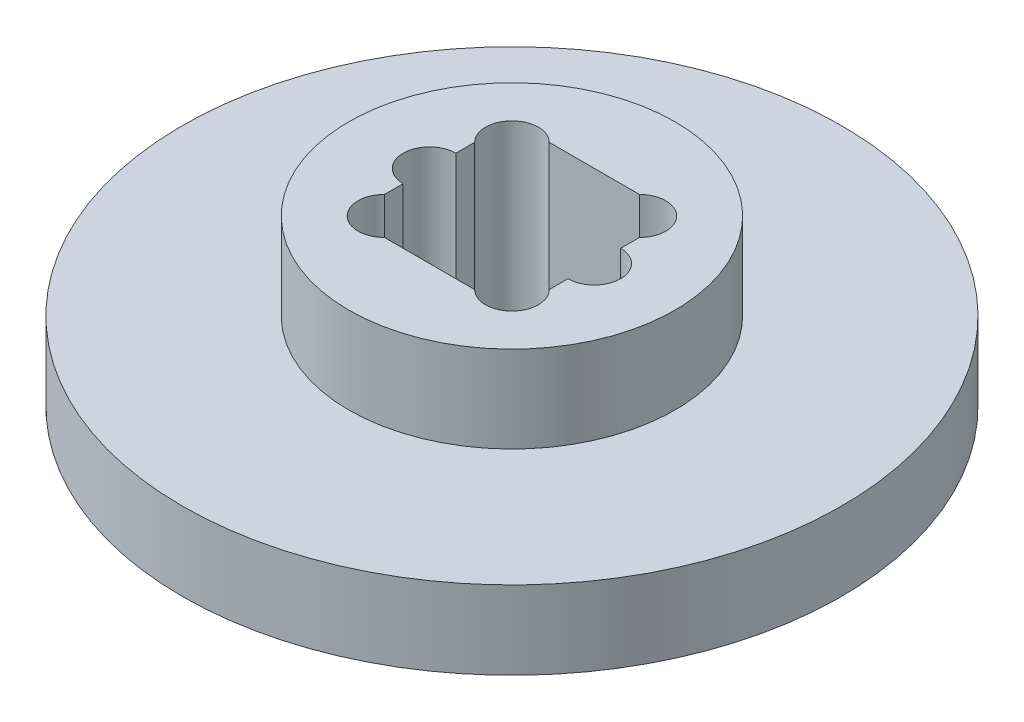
ISO-10303-21;
HEADER;
FILE_DESCRIPTION(('STEP AP214'),'2;1');
FILE_NAME('part.step','',(''),(''),'','','');
FILE_SCHEMA(('AUTOMOTIVE_DESIGN { 1 0 10303 214 1 1 1 1 }'));
ENDSEC;
DATA;
#1=APPLICATION_CONTEXT('core data for automotive mechanical design processes');
#2=APPLICATION_PROTOCOL_DEFINITION('international standard','automotive_design',2000,#1);
#3=PRODUCT_CONTEXT('',#1,'mechanical');
#4=PRODUCT('Part','Part','',(#3));
#5=PRODUCT_RELATED_PRODUCT_CATEGORY('part','',(#4));
#6=PRODUCT_DEFINITION_FORMATION('','',#4);
#7=PRODUCT_DEFINITION_CONTEXT('part definition',#1,'design');
#8=PRODUCT_DEFINITION('design','',#6,#7);
#9=PRODUCT_DEFINITION_SHAPE('','',#8);
#10=(LENGTH_UNIT() NAMED_UNIT(*) SI_UNIT(.MILLI.,.METRE.));
#11=(NAMED_UNIT(*) PLANE_ANGLE_UNIT() SI_UNIT($,.RADIAN.));
#12=(NAMED_UNIT(*) SI_UNIT($,.STERADIAN.) SOLID_ANGLE_UNIT());
#13=UNCERTAINTY_MEASURE_WITH_UNIT(LENGTH_MEASURE(1.E-05),#10,'distance_accuracy_value','');
#14=(GEOMETRIC_REPRESENTATION_CONTEXT(3) GLOBAL_UNCERTAINTY_ASSIGNED_CONTEXT((#13)) GLOBAL_UNIT_ASSIGNED_CONTEXT((#10,
#11,#12)) REPRESENTATION_CONTEXT('',''));
#15=CARTESIAN_POINT('',(0.,0.,0.));
#16=DIRECTION('',(0.,0.,1.));
#17=DIRECTION('',(1.,0.,0.));
#18=AXIS2_PLACEMENT_3D('',#15,#16,#17);
#19=CARTESIAN_POINT('',(5.,0.,-2.73725830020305));
#20=DIRECTION('',(1.,0.,0.));
#21=DIRECTION('',(0.,0.,-1.));
#22=AXIS2_PLACEMENT_3D('',#19,#20,#21);
#23=PLANE('',#22);
#24=DIRECTION('',(0.,0.,-1.));
#25=VECTOR('',#24,1.);
#26=CARTESIAN_POINT('',(5.,10.,-2.73725830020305));
#27=LINE('',#26,#25);
#28=CARTESIAN_POINT('',(4.99999999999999,10.,2.73725830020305));
#29=VERTEX_POINT('',#28);
#30=CARTESIAN_POINT('',(4.99999999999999,10.,1.6));
#31=VERTEX_POINT('',#30);
#32=EDGE_CURVE('E131',#29,#31,#27,.T.);
#33=ORIENTED_EDGE('',*,*,#32,.T.);
#34=DIRECTION('',(0.,-1.,0.));
#35=VECTOR('',#34,1.);
#36=CARTESIAN_POINT('',(4.99999999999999,10.,1.6));
#37=LINE('',#36,#35);
#38=CARTESIAN_POINT('',(4.99999999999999,0.,1.6));
#39=VERTEX_POINT('',#38);
#40=EDGE_CURVE('E11',#31,#39,#37,.T.);
#41=ORIENTED_EDGE('',*,*,#40,.T.);
#42=DIRECTION('',(0.,0.,-1.));
#43=VECTOR('',#42,1.);
#44=CARTESIAN_POINT('',(5.,0.,-2.73725830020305));
#45=LINE('',#44,#43);
#46=CARTESIAN_POINT('',(4.99999999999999,0.,2.73725830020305));
#47=VERTEX_POINT('',#46);
#48=EDGE_CURVE('E128',#47,#39,#45,.T.);
#49=ORIENTED_EDGE('',*,*,#48,.F.);
#50=DIRECTION('',(0.,1.,0.));
#51=VECTOR('',#50,1.);
#52=CARTESIAN_POINT('',(4.99999999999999,0.,2.73725830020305));
#53=LINE('',#52,#51);
#54=EDGE_CURVE('E181',#47,#29,#53,.T.);
#55=ORIENTED_EDGE('',*,*,#54,.T.);
#56=EDGE_LOOP('',(#33,#41,#49,#55));
#57=FACE_BOUND('',#56,.T.);
#58=ADVANCED_FACE('F32',(#57),#23,.F.);
#59=CARTESIAN_POINT('',(-5.,0.,-2.73725830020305));
#60=DIRECTION('',(-1.,0.,0.));
#61=DIRECTION('',(0.,0.,1.));
#62=AXIS2_PLACEMENT_3D('',#59,#60,#61);
#63=PLANE('',#62);
#64=DIRECTION('',(0.,0.,1.));
#65=VECTOR('',#64,1.);
#66=CARTESIAN_POINT('',(-5.,10.,-2.73725830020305));
#67=LINE('',#66,#65);
#68=CARTESIAN_POINT('',(-5.,10.,-2.73725830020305));
#69=VERTEX_POINT('',#68);
#70=CARTESIAN_POINT('',(-5.,10.,-1.6));
#71=VERTEX_POINT('',#70);
#72=EDGE_CURVE('E152',#69,#71,#67,.T.);
#73=ORIENTED_EDGE('',*,*,#72,.T.);
#74=DIRECTION('',(0.,-1.,0.));
#75=VECTOR('',#74,1.);
#76=CARTESIAN_POINT('',(-5.,10.,-1.6));
#77=LINE('',#76,#75);
#78=CARTESIAN_POINT('',(-5.,0.,-1.6));
#79=VERTEX_POINT('',#78);
#80=EDGE_CURVE('E205',#71,#79,#77,.T.);
#81=ORIENTED_EDGE('',*,*,#80,.T.);
#82=DIRECTION('',(0.,0.,1.));
#83=VECTOR('',#82,1.);
#84=CARTESIAN_POINT('',(-5.,0.,-2.73725830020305));
#85=LINE('',#84,#83);
#86=CARTESIAN_POINT('',(-5.,0.,-2.73725830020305));
#87=VERTEX_POINT('',#86);
#88=EDGE_CURVE('E231',#87,#79,#85,.T.);
#89=ORIENTED_EDGE('',*,*,#88,.F.);
#90=DIRECTION('',(0.,1.,0.));
#91=VECTOR('',#90,1.);
#92=CARTESIAN_POINT('',(-5.,0.,-2.73725830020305));
#93=LINE('',#92,#91);
#94=EDGE_CURVE('E148',#87,#69,#93,.T.);
#95=ORIENTED_EDGE('',*,*,#94,.T.);
#96=EDGE_LOOP('',(#73,#81,#89,#95));
#97=FACE_BOUND('',#96,.T.);
#98=ADVANCED_FACE('F261',(#97),#63,.F.);
#99=CARTESIAN_POINT('',(0.,4.75,0.));
#100=DIRECTION('',(0.,1.,0.));
#101=DIRECTION('',(0.,0.,1.));
#102=AXIS2_PLACEMENT_3D('',#99,#100,#101);
#103=PLANE('',#102);
#104=CARTESIAN_POINT('',(0.,4.75,0.));
#105=DIRECTION('',(0.,1.,0.));
#106=DIRECTION('',(0.,0.,1.));
#107=AXIS2_PLACEMENT_3D('',#104,#105,#106);
#108=CIRCLE('',#107,20.);
#109=CARTESIAN_POINT('',(0.,4.75,20.));
#110=VERTEX_POINT('',#109);
#111=EDGE_CURVE('E198',#110,#110,#108,.T.);
#112=ORIENTED_EDGE('',*,*,#111,.T.);
#113=EDGE_LOOP('',(#112));
#114=FACE_BOUND('',#113,.T.);
#115=CARTESIAN_POINT('',(0.,4.75,0.));
#116=DIRECTION('',(0.,1.,0.));
#117=DIRECTION('',(0.,0.,1.));
#118=AXIS2_PLACEMENT_3D('',#115,#116,#117);
#119=CIRCLE('',#118,9.9);
#120=CARTESIAN_POINT('',(0.,4.75,-9.9));
#121=VERTEX_POINT('',#120);
#122=EDGE_CURVE('E175',#121,#121,#119,.T.);
#123=ORIENTED_EDGE('',*,*,#122,.F.);
#124=EDGE_LOOP('',(#123));
#125=FACE_BOUND('',#124,.T.);
#126=ADVANCED_FACE('F263',(#114,#125),#103,.T.);
#127=CARTESIAN_POINT('',(0.,4.75,0.));
#128=DIRECTION('',(0.,-1.,0.));
#129=DIRECTION('',(0.,0.,-1.));
#130=AXIS2_PLACEMENT_3D('',#127,#128,#129);
#131=CYLINDRICAL_SURFACE('',#130,20.);
#132=ORIENTED_EDGE('',*,*,#111,.F.);
#133=EDGE_LOOP('',(#132));
#134=FACE_BOUND('',#133,.T.);
#135=CARTESIAN_POINT('',(0.,0.,0.));
#136=DIRECTION('',(0.,1.,0.));
#137=DIRECTION('',(0.,0.,1.));
#138=AXIS2_PLACEMENT_3D('',#135,#136,#137);
#139=CIRCLE('',#138,20.);
#140=CARTESIAN_POINT('',(0.,0.,20.));
#141=VERTEX_POINT('',#140);
#142=EDGE_CURVE('E195',#141,#141,#139,.T.);
#143=ORIENTED_EDGE('',*,*,#142,.T.);
#144=EDGE_LOOP('',(#143));
#145=FACE_BOUND('',#144,.T.);
#146=ADVANCED_FACE('F34',(#134,#145),#131,.T.);
#147=CARTESIAN_POINT('',(0.,0.,0.));
#148=DIRECTION('',(0.,1.,0.));
#149=DIRECTION('',(0.,0.,1.));
#150=AXIS2_PLACEMENT_3D('',#147,#148,#149);
#151=PLANE('',#150);
#152=ORIENTED_EDGE('',*,*,#48,.T.);
#153=CARTESIAN_POINT('',(5.,0.,0.));
#154=DIRECTION('',(0.,-1.,0.));
#155=DIRECTION('',(0.,0.,1.));
#156=AXIS2_PLACEMENT_3D('',#153,#154,#155);
#157=CIRCLE('',#156,1.6);
#158=CARTESIAN_POINT('',(5.,0.,-1.6));
#159=VERTEX_POINT('',#158);
#160=EDGE_CURVE('E119',#159,#39,#157,.T.);
#161=ORIENTED_EDGE('',*,*,#160,.F.);
#162=CARTESIAN_POINT('',(5.,0.,-2.73725830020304));
#163=VERTEX_POINT('',#162);
#164=EDGE_CURVE('E138',#159,#163,#45,.T.);
#165=ORIENTED_EDGE('',*,*,#164,.T.);
#166=CARTESIAN_POINT('',(3.86862915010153,0.,-3.86862915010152));
#167=DIRECTION('',(0.,1.,0.));
#168=DIRECTION('',(0.,0.,-1.));
#169=AXIS2_PLACEMENT_3D('',#166,#167,#168);
#170=CIRCLE('',#169,1.6);
#171=CARTESIAN_POINT('',(2.73725830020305,0.,-5.));
#172=VERTEX_POINT('',#171);
#173=EDGE_CURVE('E137',#163,#172,#170,.T.);
#174=ORIENTED_EDGE('',*,*,#173,.T.);
#175=DIRECTION('',(-1.,0.,0.));
#176=VECTOR('',#175,1.);
#177=CARTESIAN_POINT('',(-2.73725830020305,0.,-5.));
#178=LINE('',#177,#176);
#179=CARTESIAN_POINT('',(-2.73725830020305,0.,-5.));
#180=VERTEX_POINT('',#179);
#181=EDGE_CURVE('E141',#172,#180,#178,.T.);
#182=ORIENTED_EDGE('',*,*,#181,.T.);
#183=CARTESIAN_POINT('',(-3.86862915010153,0.,-3.86862915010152));
#184=DIRECTION('',(0.,1.,0.));
#185=DIRECTION('',(0.,0.,1.));
#186=AXIS2_PLACEMENT_3D('',#183,#184,#185);
#187=CIRCLE('',#186,1.6);
#188=EDGE_CURVE('E172',#180,#87,#187,.T.);
#189=ORIENTED_EDGE('',*,*,#188,.T.);
#190=ORIENTED_EDGE('',*,*,#88,.T.);
#191=CARTESIAN_POINT('',(-5.,0.,0.));
#192=DIRECTION('',(0.,-1.,0.));
#193=DIRECTION('',(0.,0.,-1.));
#194=AXIS2_PLACEMENT_3D('',#191,#192,#193);
#195=CIRCLE('',#194,1.6);
#196=CARTESIAN_POINT('',(-5.,0.,1.6));
#197=VERTEX_POINT('',#196);
#198=EDGE_CURVE('E234',#197,#79,#195,.T.);
#199=ORIENTED_EDGE('',*,*,#198,.F.);
#200=CARTESIAN_POINT('',(-5.,0.,2.73725830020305));
#201=VERTEX_POINT('',#200);
#202=EDGE_CURVE('E229',#197,#201,#85,.T.);
#203=ORIENTED_EDGE('',*,*,#202,.T.);
#204=CARTESIAN_POINT('',(-3.86862915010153,0.,3.86862915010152));
#205=DIRECTION('',(0.,1.,0.));
#206=DIRECTION('',(0.,0.,-1.));
#207=AXIS2_PLACEMENT_3D('',#204,#205,#206);
#208=CIRCLE('',#207,1.6);
#209=CARTESIAN_POINT('',(-2.73725830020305,0.,5.));
#210=VERTEX_POINT('',#209);
#211=EDGE_CURVE('E237',#201,#210,#208,.T.);
#212=ORIENTED_EDGE('',*,*,#211,.T.);
#213=DIRECTION('',(1.,0.,0.));
#214=VECTOR('',#213,1.);
#215=CARTESIAN_POINT('',(-2.73725830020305,0.,5.));
#216=LINE('',#215,#214);
#217=CARTESIAN_POINT('',(2.73725830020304,0.,5.));
#218=VERTEX_POINT('',#217);
#219=EDGE_CURVE('E239',#210,#218,#216,.T.);
#220=ORIENTED_EDGE('',*,*,#219,.T.);
#221=CARTESIAN_POINT('',(3.86862915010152,0.,3.86862915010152));
#222=DIRECTION('',(0.,1.,0.));
#223=DIRECTION('',(0.,0.,1.));
#224=AXIS2_PLACEMENT_3D('',#221,#222,#223);
#225=CIRCLE('',#224,1.6);
#226=EDGE_CURVE('E136',#218,#47,#225,.T.);
#227=ORIENTED_EDGE('',*,*,#226,.T.);
#228=EDGE_LOOP('',(#152,#161,#165,#174,#182,#189,#190,#199,#203,#212,#220,#227));
#229=FACE_BOUND('',#228,.T.);
#230=ORIENTED_EDGE('',*,*,#142,.F.);
#231=EDGE_LOOP('',(#230));
#232=FACE_BOUND('',#231,.T.);
#233=ADVANCED_FACE('F132',(#229,#232),#151,.F.);
#234=CARTESIAN_POINT('',(0.,10.,0.));
#235=DIRECTION('',(0.,-1.,0.));
#236=DIRECTION('',(0.,0.,-1.));
#237=AXIS2_PLACEMENT_3D('',#234,#235,#236);
#238=CYLINDRICAL_SURFACE('',#237,9.9);
#239=CARTESIAN_POINT('',(0.,10.,0.));
#240=DIRECTION('',(0.,1.,0.));
#241=DIRECTION('',(0.,0.,1.));
#242=AXIS2_PLACEMENT_3D('',#239,#240,#241);
#243=CIRCLE('',#242,9.9);
#244=CARTESIAN_POINT('',(0.,10.,-9.9));
#245=VERTEX_POINT('',#244);
#246=EDGE_CURVE('E192',#245,#245,#243,.T.);
#247=CARTESIAN_POINT('',(0.,10.,-9.9));
#248=CARTESIAN_POINT('',(0.,9.9453125,-9.9));
#249=CARTESIAN_POINT('',(0.,9.890625,-9.9));
#250=CARTESIAN_POINT('',(0.,9.78125,-9.9));
#251=CARTESIAN_POINT('',(0.,9.7265625,-9.9));
#252=CARTESIAN_POINT('',(0.,9.6171875,-9.9));
#253=CARTESIAN_POINT('',(0.,9.5625,-9.9));
#254=CARTESIAN_POINT('',(0.,9.453125,-9.9));
#255=CARTESIAN_POINT('',(0.,9.3984375,-9.9));
#256=CARTESIAN_POINT('',(0.,9.2890625,-9.9));
#257=CARTESIAN_POINT('',(0.,9.234375,-9.9));
#258=CARTESIAN_POINT('',(0.,9.125,-9.9));
#259=CARTESIAN_POINT('',(0.,9.0703125,-9.9));
#260=CARTESIAN_POINT('',(0.,8.9609375,-9.9));
#261=CARTESIAN_POINT('',(0.,8.90625,-9.9));
#262=CARTESIAN_POINT('',(0.,8.796875,-9.9));
#263=CARTESIAN_POINT('',(0.,8.7421875,-9.9));
#264=CARTESIAN_POINT('',(0.,8.6328125,-9.9));
#265=CARTESIAN_POINT('',(0.,8.578125,-9.9));
#266=CARTESIAN_POINT('',(0.,8.46875,-9.9));
#267=CARTESIAN_POINT('',(0.,8.4140625,-9.9));
#268=CARTESIAN_POINT('',(0.,8.3046875,-9.9));
#269=CARTESIAN_POINT('',(0.,8.25,-9.9));
#270=CARTESIAN_POINT('',(0.,8.140625,-9.9));
#271=CARTESIAN_POINT('',(0.,8.0859375,-9.9));
#272=CARTESIAN_POINT('',(0.,7.9765625,-9.9));
#273=CARTESIAN_POINT('',(0.,7.921875,-9.9));
#274=CARTESIAN_POINT('',(0.,7.8125,-9.9));
#275=CARTESIAN_POINT('',(0.,7.7578125,-9.9));
#276=CARTESIAN_POINT('',(0.,7.6484375,-9.9));
#277=CARTESIAN_POINT('',(0.,7.59375,-9.9));
#278=CARTESIAN_POINT('',(0.,7.484375,-9.9));
#279=CARTESIAN_POINT('',(0.,7.4296875,-9.9));
#280=CARTESIAN_POINT('',(0.,7.3203125,-9.9));
#281=CARTESIAN_POINT('',(0.,7.265625,-9.9));
#282=CARTESIAN_POINT('',(0.,7.15625,-9.9));
#283=CARTESIAN_POINT('',(0.,7.1015625,-9.9));
#284=CARTESIAN_POINT('',(0.,6.9921875,-9.9));
#285=CARTESIAN_POINT('',(0.,6.9375,-9.9));
#286=CARTESIAN_POINT('',(0.,6.828125,-9.9));
#287=CARTESIAN_POINT('',(0.,6.7734375,-9.9));
#288=CARTESIAN_POINT('',(0.,6.6640625,-9.9));
#289=CARTESIAN_POINT('',(0.,6.609375,-9.9));
#290=CARTESIAN_POINT('',(0.,6.5,-9.9));
#291=CARTESIAN_POINT('',(0.,6.4453125,-9.9));
#292=CARTESIAN_POINT('',(0.,6.3359375,-9.9));
#293=CARTESIAN_POINT('',(0.,6.28125,-9.9));
#294=CARTESIAN_POINT('',(0.,6.171875,-9.9));
#295=CARTESIAN_POINT('',(0.,6.1171875,-9.9));
#296=CARTESIAN_POINT('',(0.,6.0078125,-9.9));
#297=CARTESIAN_POINT('',(0.,5.953125,-9.9));
#298=CARTESIAN_POINT('',(0.,5.84375,-9.9));
#299=CARTESIAN_POINT('',(0.,5.7890625,-9.9));
#300=CARTESIAN_POINT('',(0.,5.6796875,-9.9));
#301=CARTESIAN_POINT('',(0.,5.625,-9.9));
#302=CARTESIAN_POINT('',(0.,5.515625,-9.9));
#303=CARTESIAN_POINT('',(0.,5.4609375,-9.9));
#304=CARTESIAN_POINT('',(0.,5.3515625,-9.9));
#305=CARTESIAN_POINT('',(0.,5.296875,-9.9));
#306=CARTESIAN_POINT('',(0.,5.1875,-9.9));
#307=CARTESIAN_POINT('',(0.,5.1328125,-9.9));
#308=CARTESIAN_POINT('',(0.,5.0234375,-9.9));
#309=CARTESIAN_POINT('',(0.,4.96875,-9.9));
#310=CARTESIAN_POINT('',(0.,4.859375,-9.9));
#311=CARTESIAN_POINT('',(0.,4.8046875,-9.9));
#312=CARTESIAN_POINT('',(0.,4.75,-9.9));
#313=B_SPLINE_CURVE_WITH_KNOTS('',3,(#247,#248,#249,#250,#251,#252,#253,#254,#255,#256,#257,
#258,#259,#260,#261,#262,#263,#264,#265,#266,#267,#268,#269,#270,#271,#272,#273,#274,#275,#276,
#277,#278,#279,#280,#281,#282,#283,#284,#285,#286,#287,#288,#289,#290,#291,#292,#293,#294,#295,
#296,#297,#298,#299,#300,#301,#302,#303,#304,#305,#306,#307,#308,#309,#310,#311,#312),
.UNSPECIFIED.,.F.,.F.,(4,2,2,2,2,2,2,2,2,2,2,2,2,2,2,2,2,2,2,2,2,2,2,2,2,2,2,2,2,2,2,2,4),(0.,
0.164062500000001,0.328125,0.492187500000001,0.656250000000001,0.820312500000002,
0.984375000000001,1.1484375,1.3125,1.4765625,1.640625,1.8046875,1.96875,2.1328125,2.296875,
2.4609375,2.625,2.7890625,2.953125,3.1171875,3.28125,3.4453125,3.609375,3.7734375,3.9375,
4.1015625,4.265625,4.4296875,4.59375,4.7578125,4.921875,5.0859375,5.25),.UNSPECIFIED.);
#314=EDGE_CURVE('BSEAM323',#245,#121,#313,.T.);
#315=ORIENTED_EDGE('',*,*,#246,.F.);
#316=ORIENTED_EDGE('',*,*,#122,.T.);
#317=ORIENTED_EDGE('',*,*,#314,.T.);
#318=ORIENTED_EDGE('',*,*,#314,.F.);
#319=EDGE_LOOP('',(#315,#317,#316,#318));
#320=FACE_BOUND('',#319,.T.);
#321=ADVANCED_FACE('F323',(#320),#238,.T.);
#322=CARTESIAN_POINT('',(0.,10.,0.));
#323=DIRECTION('',(0.,1.,0.));
#324=DIRECTION('',(0.,0.,1.));
#325=AXIS2_PLACEMENT_3D('',#322,#323,#324);
#326=PLANE('',#325);
#327=CARTESIAN_POINT('',(5.,10.,0.));
#328=DIRECTION('',(0.,-1.,0.));
#329=DIRECTION('',(0.,0.,1.));
#330=AXIS2_PLACEMENT_3D('',#327,#328,#329);
#331=CIRCLE('',#330,1.6);
#332=CARTESIAN_POINT('',(5.,10.,-1.6));
#333=VERTEX_POINT('',#332);
#334=EDGE_CURVE('E47',#333,#31,#331,.T.);
#335=ORIENTED_EDGE('',*,*,#334,.T.);
#336=ORIENTED_EDGE('',*,*,#32,.F.);
#337=CARTESIAN_POINT('',(3.86862915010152,10.,3.86862915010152));
#338=DIRECTION('',(0.,1.,0.));
#339=DIRECTION('',(0.,0.,1.));
#340=AXIS2_PLACEMENT_3D('',#337,#338,#339);
#341=CIRCLE('',#340,1.6);
#342=CARTESIAN_POINT('',(2.73725830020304,10.,5.));
#343=VERTEX_POINT('',#342);
#344=EDGE_CURVE('E161',#343,#29,#341,.T.);
#345=ORIENTED_EDGE('',*,*,#344,.F.);
#346=DIRECTION('',(1.,0.,0.));
#347=VECTOR('',#346,1.);
#348=CARTESIAN_POINT('',(-2.73725830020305,10.,5.));
#349=LINE('',#348,#347);
#350=CARTESIAN_POINT('',(-2.73725830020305,10.,5.));
#351=VERTEX_POINT('',#350);
#352=EDGE_CURVE('E158',#351,#343,#349,.T.);
#353=ORIENTED_EDGE('',*,*,#352,.F.);
#354=CARTESIAN_POINT('',(-3.86862915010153,10.,3.86862915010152));
#355=DIRECTION('',(0.,1.,0.));
#356=DIRECTION('',(0.,0.,-1.));
#357=AXIS2_PLACEMENT_3D('',#354,#355,#356);
#358=CIRCLE('',#357,1.6);
#359=CARTESIAN_POINT('',(-5.,10.,2.73725830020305));
#360=VERTEX_POINT('',#359);
#361=EDGE_CURVE('E155',#360,#351,#358,.T.);
#362=ORIENTED_EDGE('',*,*,#361,.F.);
#363=CARTESIAN_POINT('',(-5.,10.,1.6));
#364=VERTEX_POINT('',#363);
#365=EDGE_CURVE('E151',#364,#360,#67,.T.);
#366=ORIENTED_EDGE('',*,*,#365,.F.);
#367=CARTESIAN_POINT('',(-5.,10.,0.));
#368=DIRECTION('',(0.,-1.,0.));
#369=DIRECTION('',(0.,0.,-1.));
#370=AXIS2_PLACEMENT_3D('',#367,#368,#369);
#371=CIRCLE('',#370,1.6);
#372=EDGE_CURVE('E55',#364,#71,#371,.T.);
#373=ORIENTED_EDGE('',*,*,#372,.T.);
#374=ORIENTED_EDGE('',*,*,#72,.F.);
#375=CARTESIAN_POINT('',(-3.86862915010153,10.,-3.86862915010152));
#376=DIRECTION('',(0.,1.,0.));
#377=DIRECTION('',(0.,0.,1.));
#378=AXIS2_PLACEMENT_3D('',#375,#376,#377);
#379=CIRCLE('',#378,1.6);
#380=CARTESIAN_POINT('',(-2.73725830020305,10.,-5.));
#381=VERTEX_POINT('',#380);
#382=EDGE_CURVE('E149',#381,#69,#379,.T.);
#383=ORIENTED_EDGE('',*,*,#382,.F.);
#384=DIRECTION('',(-1.,0.,0.));
#385=VECTOR('',#384,1.);
#386=CARTESIAN_POINT('',(-2.73725830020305,10.,-5.));
#387=LINE('',#386,#385);
#388=CARTESIAN_POINT('',(2.73725830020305,10.,-5.));
#389=VERTEX_POINT('',#388);
#390=EDGE_CURVE('E169',#389,#381,#387,.T.);
#391=ORIENTED_EDGE('',*,*,#390,.F.);
#392=CARTESIAN_POINT('',(3.86862915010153,10.,-3.86862915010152));
#393=DIRECTION('',(0.,1.,0.));
#394=DIRECTION('',(0.,0.,-1.));
#395=AXIS2_PLACEMENT_3D('',#392,#393,#394);
#396=CIRCLE('',#395,1.6);
#397=CARTESIAN_POINT('',(5.,10.,-2.73725830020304));
#398=VERTEX_POINT('',#397);
#399=EDGE_CURVE('E166',#398,#389,#396,.T.);
#400=ORIENTED_EDGE('',*,*,#399,.F.);
#401=EDGE_CURVE('E164',#333,#398,#27,.T.);
#402=ORIENTED_EDGE('',*,*,#401,.F.);
#403=EDGE_LOOP('',(#335,#336,#345,#353,#362,#366,#373,#374,#383,#391,#400,#402));
#404=FACE_BOUND('',#403,.T.);
#405=ORIENTED_EDGE('',*,*,#246,.T.);
#406=EDGE_LOOP('',(#405));
#407=FACE_BOUND('',#406,.T.);
#408=ADVANCED_FACE('F213',(#404,#407),#326,.T.);
#409=CARTESIAN_POINT('',(-3.86862915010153,0.,-3.86862915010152));
#410=DIRECTION('',(0.,1.,0.));
#411=DIRECTION('',(0.,0.,1.));
#412=AXIS2_PLACEMENT_3D('',#409,#410,#411);
#413=CYLINDRICAL_SURFACE('',#412,1.6);
#414=ORIENTED_EDGE('',*,*,#382,.T.);
#415=ORIENTED_EDGE('',*,*,#94,.F.);
#416=ORIENTED_EDGE('',*,*,#188,.F.);
#417=DIRECTION('',(0.,1.,0.));
#418=VECTOR('',#417,1.);
#419=CARTESIAN_POINT('',(-2.73725830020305,0.,-5.));
#420=LINE('',#419,#418);
#421=EDGE_CURVE('E173',#180,#381,#420,.T.);
#422=ORIENTED_EDGE('',*,*,#421,.T.);
#423=EDGE_LOOP('',(#414,#415,#416,#422));
#424=FACE_BOUND('',#423,.T.);
#425=ADVANCED_FACE('F227',(#424),#413,.F.);
#426=CARTESIAN_POINT('',(-2.73725830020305,0.,-5.));
#427=DIRECTION('',(0.,0.,-1.));
#428=DIRECTION('',(-1.,0.,0.));
#429=AXIS2_PLACEMENT_3D('',#426,#427,#428);
#430=PLANE('',#429);
#431=ORIENTED_EDGE('',*,*,#390,.T.);
#432=ORIENTED_EDGE('',*,*,#421,.F.);
#433=ORIENTED_EDGE('',*,*,#181,.F.);
#434=DIRECTION('',(0.,1.,0.));
#435=VECTOR('',#434,1.);
#436=CARTESIAN_POINT('',(2.73725830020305,0.,-5.));
#437=LINE('',#436,#435);
#438=EDGE_CURVE('E176',#172,#389,#437,.T.);
#439=ORIENTED_EDGE('',*,*,#438,.T.);
#440=EDGE_LOOP('',(#431,#432,#433,#439));
#441=FACE_BOUND('',#440,.T.);
#442=ADVANCED_FACE('F225',(#441),#430,.F.);
#443=CARTESIAN_POINT('',(3.86862915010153,0.,-3.86862915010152));
#444=DIRECTION('',(0.,1.,0.));
#445=DIRECTION('',(0.,0.,1.));
#446=AXIS2_PLACEMENT_3D('',#443,#444,#445);
#447=CYLINDRICAL_SURFACE('',#446,1.6);
#448=ORIENTED_EDGE('',*,*,#399,.T.);
#449=ORIENTED_EDGE('',*,*,#438,.F.);
#450=ORIENTED_EDGE('',*,*,#173,.F.);
#451=DIRECTION('',(0.,1.,0.));
#452=VECTOR('',#451,1.);
#453=CARTESIAN_POINT('',(5.,0.,-2.73725830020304));
#454=LINE('',#453,#452);
#455=EDGE_CURVE('E178',#163,#398,#454,.T.);
#456=ORIENTED_EDGE('',*,*,#455,.T.);
#457=EDGE_LOOP('',(#448,#449,#450,#456));
#458=FACE_BOUND('',#457,.T.);
#459=ADVANCED_FACE('F218',(#458),#447,.F.);
#460=ORIENTED_EDGE('',*,*,#164,.F.);
#461=DIRECTION('',(0.,-1.,0.));
#462=VECTOR('',#461,1.);
#463=CARTESIAN_POINT('',(5.,10.,-1.6));
#464=LINE('',#463,#462);
#465=EDGE_CURVE('E40',#159,#333,#464,.F.);
#466=ORIENTED_EDGE('',*,*,#465,.T.);
#467=ORIENTED_EDGE('',*,*,#401,.T.);
#468=ORIENTED_EDGE('',*,*,#455,.F.);
#469=EDGE_LOOP('',(#460,#466,#467,#468));
#470=FACE_BOUND('',#469,.T.);
#471=ADVANCED_FACE('F209',(#470),#23,.F.);
#472=CARTESIAN_POINT('',(3.86862915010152,0.,3.86862915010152));
#473=DIRECTION('',(0.,1.,0.));
#474=DIRECTION('',(0.,0.,1.));
#475=AXIS2_PLACEMENT_3D('',#472,#473,#474);
#476=CYLINDRICAL_SURFACE('',#475,1.6);
#477=ORIENTED_EDGE('',*,*,#344,.T.);
#478=ORIENTED_EDGE('',*,*,#54,.F.);
#479=ORIENTED_EDGE('',*,*,#226,.F.);
#480=DIRECTION('',(0.,1.,0.));
#481=VECTOR('',#480,1.);
#482=CARTESIAN_POINT('',(2.73725830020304,0.,5.));
#483=LINE('',#482,#481);
#484=EDGE_CURVE('E183',#218,#343,#483,.T.);
#485=ORIENTED_EDGE('',*,*,#484,.T.);
#486=EDGE_LOOP('',(#477,#478,#479,#485));
#487=FACE_BOUND('',#486,.T.);
#488=ADVANCED_FACE('F247',(#487),#476,.F.);
#489=CARTESIAN_POINT('',(-2.73725830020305,0.,5.));
#490=DIRECTION('',(0.,0.,1.));
#491=DIRECTION('',(1.,0.,0.));
#492=AXIS2_PLACEMENT_3D('',#489,#490,#491);
#493=PLANE('',#492);
#494=ORIENTED_EDGE('',*,*,#352,.T.);
#495=ORIENTED_EDGE('',*,*,#484,.F.);
#496=ORIENTED_EDGE('',*,*,#219,.F.);
#497=DIRECTION('',(0.,1.,0.));
#498=VECTOR('',#497,1.);
#499=CARTESIAN_POINT('',(-2.73725830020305,0.,5.));
#500=LINE('',#499,#498);
#501=EDGE_CURVE('E185',#210,#351,#500,.T.);
#502=ORIENTED_EDGE('',*,*,#501,.T.);
#503=EDGE_LOOP('',(#494,#495,#496,#502));
#504=FACE_BOUND('',#503,.T.);
#505=ADVANCED_FACE('F243',(#504),#493,.F.);
#506=CARTESIAN_POINT('',(-3.86862915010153,0.,3.86862915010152));
#507=DIRECTION('',(0.,1.,0.));
#508=DIRECTION('',(0.,0.,1.));
#509=AXIS2_PLACEMENT_3D('',#506,#507,#508);
#510=CYLINDRICAL_SURFACE('',#509,1.6);
#511=ORIENTED_EDGE('',*,*,#361,.T.);
#512=ORIENTED_EDGE('',*,*,#501,.F.);
#513=ORIENTED_EDGE('',*,*,#211,.F.);
#514=DIRECTION('',(0.,1.,0.));
#515=VECTOR('',#514,1.);
#516=CARTESIAN_POINT('',(-5.,0.,2.73725830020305));
#517=LINE('',#516,#515);
#518=EDGE_CURVE('E187',#201,#360,#517,.T.);
#519=ORIENTED_EDGE('',*,*,#518,.T.);
#520=EDGE_LOOP('',(#511,#512,#513,#519));
#521=FACE_BOUND('',#520,.T.);
#522=ADVANCED_FACE('F251',(#521),#510,.F.);
#523=ORIENTED_EDGE('',*,*,#202,.F.);
#524=DIRECTION('',(0.,-1.,0.));
#525=VECTOR('',#524,1.);
#526=CARTESIAN_POINT('',(-5.,10.,1.6));
#527=LINE('',#526,#525);
#528=EDGE_CURVE('E201',#197,#364,#527,.F.);
#529=ORIENTED_EDGE('',*,*,#528,.T.);
#530=ORIENTED_EDGE('',*,*,#365,.T.);
#531=ORIENTED_EDGE('',*,*,#518,.F.);
#532=EDGE_LOOP('',(#523,#529,#530,#531));
#533=FACE_BOUND('',#532,.T.);
#534=ADVANCED_FACE('F255',(#533),#63,.F.);
#535=CARTESIAN_POINT('',(-5.,10.,0.));
#536=DIRECTION('',(0.,-1.,0.));
#537=DIRECTION('',(0.,0.,-1.));
#538=AXIS2_PLACEMENT_3D('',#535,#536,#537);
#539=CYLINDRICAL_SURFACE('',#538,1.6);
#540=ORIENTED_EDGE('',*,*,#372,.F.);
#541=ORIENTED_EDGE('',*,*,#528,.F.);
#542=ORIENTED_EDGE('',*,*,#198,.T.);
#543=ORIENTED_EDGE('',*,*,#80,.F.);
#544=EDGE_LOOP('',(#540,#541,#542,#543));
#545=FACE_BOUND('',#544,.T.);
#546=ADVANCED_FACE('F257',(#545),#539,.F.);
#547=CARTESIAN_POINT('',(5.,10.,0.));
#548=DIRECTION('',(0.,-1.,0.));
#549=DIRECTION('',(0.,0.,-1.));
#550=AXIS2_PLACEMENT_3D('',#547,#548,#549);
#551=CYLINDRICAL_SURFACE('',#550,1.6);
#552=ORIENTED_EDGE('',*,*,#334,.F.);
#553=ORIENTED_EDGE('',*,*,#465,.F.);
#554=ORIENTED_EDGE('',*,*,#160,.T.);
#555=ORIENTED_EDGE('',*,*,#40,.F.);
#556=EDGE_LOOP('',(#552,#553,#554,#555));
#557=FACE_BOUND('',#556,.T.);
#558=ADVANCED_FACE('F120',(#557),#551,.F.);
#559=CLOSED_SHELL('',(#58,#98,#126,#146,#233,#321,#408,#425,#442,#459,#471,#488,#505,#522,#534,
#546,#558));
#560=MANIFOLD_SOLID_BREP('B2',#559);
#561=ADVANCED_BREP_SHAPE_REPRESENTATION('',(#18,#560),#14);
#562=SHAPE_DEFINITION_REPRESENTATION(#9,#561);
ENDSEC;
END-ISO-10303-21;
